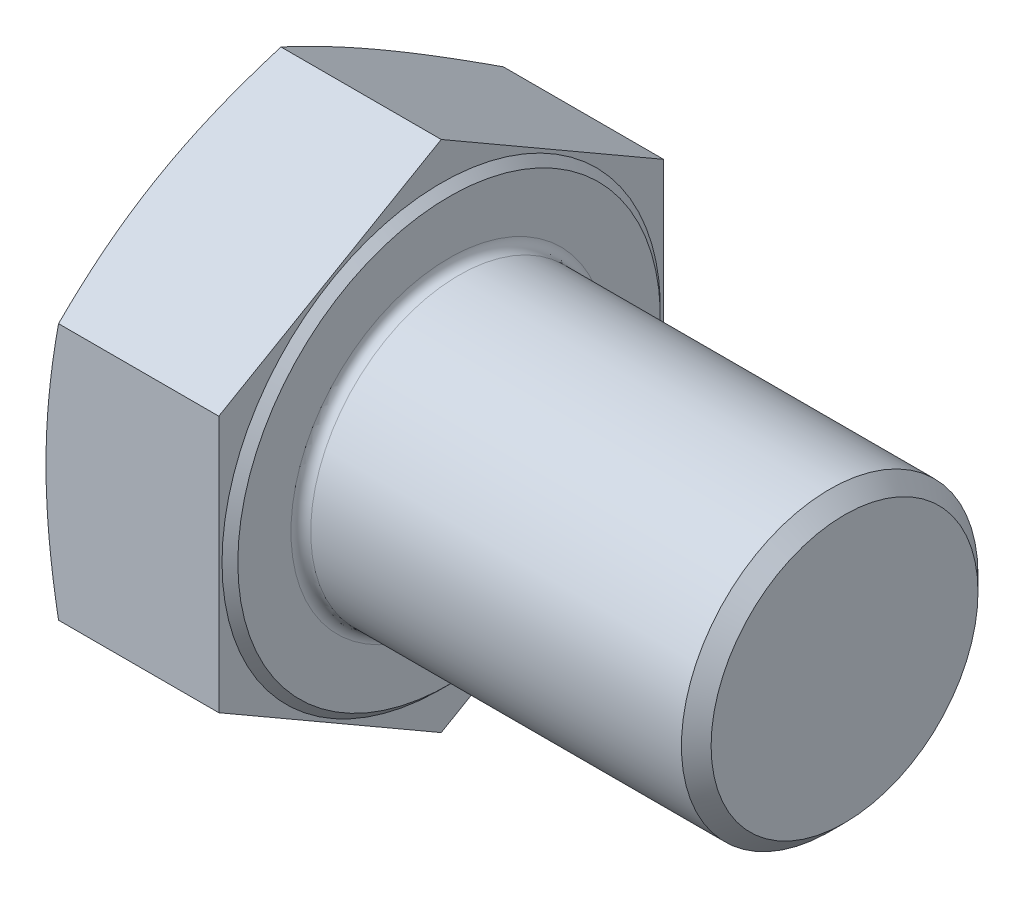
ISO-10303-21;
HEADER;
FILE_DESCRIPTION(('STEP AP214'),'2;1');
FILE_NAME('part.step','',(''),(''),'','','');
FILE_SCHEMA(('AUTOMOTIVE_DESIGN { 1 0 10303 214 1 1 1 1 }'));
ENDSEC;
DATA;
#1=APPLICATION_CONTEXT('core data for automotive mechanical design processes');
#2=APPLICATION_PROTOCOL_DEFINITION('international standard','automotive_design',2000,#1);
#3=PRODUCT_CONTEXT('',#1,'mechanical');
#4=PRODUCT('Part','Part','',(#3));
#5=PRODUCT_RELATED_PRODUCT_CATEGORY('part','',(#4));
#6=PRODUCT_DEFINITION_FORMATION('','',#4);
#7=PRODUCT_DEFINITION_CONTEXT('part definition',#1,'design');
#8=PRODUCT_DEFINITION('design','',#6,#7);
#9=PRODUCT_DEFINITION_SHAPE('','',#8);
#10=(LENGTH_UNIT() NAMED_UNIT(*) SI_UNIT(.MILLI.,.METRE.));
#11=(NAMED_UNIT(*) PLANE_ANGLE_UNIT() SI_UNIT($,.RADIAN.));
#12=(NAMED_UNIT(*) SI_UNIT($,.STERADIAN.) SOLID_ANGLE_UNIT());
#13=UNCERTAINTY_MEASURE_WITH_UNIT(LENGTH_MEASURE(1.E-05),#10,'distance_accuracy_value','');
#14=(GEOMETRIC_REPRESENTATION_CONTEXT(3) GLOBAL_UNCERTAINTY_ASSIGNED_CONTEXT((#13)) GLOBAL_UNIT_ASSIGNED_CONTEXT((#10,
#11,#12)) REPRESENTATION_CONTEXT('',''));
#15=CARTESIAN_POINT('',(0.,0.,0.));
#16=DIRECTION('',(0.,0.,1.));
#17=DIRECTION('',(1.,0.,0.));
#18=AXIS2_PLACEMENT_3D('',#15,#16,#17);
#19=CARTESIAN_POINT('',(18.28,-12.9903810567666,-22.5));
#20=DIRECTION('',(1.,0.,0.));
#21=DIRECTION('',(0.,0.,-1.));
#22=AXIS2_PLACEMENT_3D('',#19,#20,#21);
#23=PLANE('',#22);
#24=CARTESIAN_POINT('',(18.28,0.,0.));
#25=DIRECTION('',(1.,0.,0.));
#26=DIRECTION('',(0.,0.,-1.));
#27=AXIS2_PLACEMENT_3D('',#24,#25,#26);
#28=CIRCLE('',#27,16.);
#29=CARTESIAN_POINT('',(18.28,0.,-16.));
#30=VERTEX_POINT('',#29);
#31=EDGE_CURVE('E11',#30,#30,#28,.F.);
#32=ORIENTED_EDGE('',*,*,#31,.T.);
#33=EDGE_LOOP('',(#32));
#34=FACE_BOUND('',#33,.T.);
#35=CARTESIAN_POINT('',(18.28,0.,0.));
#36=DIRECTION('',(-1.,0.,0.));
#37=DIRECTION('',(0.,0.,1.));
#38=AXIS2_PLACEMENT_3D('',#35,#36,#37);
#39=CIRCLE('',#38,21.375);
#40=CARTESIAN_POINT('',(18.28,0.,21.375));
#41=VERTEX_POINT('',#40);
#42=EDGE_CURVE('E415',#41,#41,#39,.T.);
#43=ORIENTED_EDGE('',*,*,#42,.F.);
#44=EDGE_LOOP('',(#43));
#45=FACE_BOUND('',#44,.T.);
#46=ADVANCED_FACE('F34',(#34,#45),#23,.T.);
#47=CARTESIAN_POINT('',(18.28,-25.9807621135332,0.));
#48=DIRECTION('',(0.,0.866025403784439,0.5));
#49=DIRECTION('',(0.,-0.5,0.866025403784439));
#50=AXIS2_PLACEMENT_3D('',#47,#48,#49);
#51=PLANE('',#50);
#52=CARTESIAN_POINT('',(1.26693582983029,-12.9902655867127,-22.5002));
#53=CARTESIAN_POINT('',(1.16902690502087,-13.2592880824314,-22.0342393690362));
#54=CARTESIAN_POINT('',(1.07552121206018,-13.5287059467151,-21.5675939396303));
#55=CARTESIAN_POINT('',(0.898284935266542,-14.0683691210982,-20.6328699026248));
#56=CARTESIAN_POINT('',(0.814555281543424,-14.3386145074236,-20.1647911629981));
#57=CARTESIAN_POINT('',(0.579402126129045,-15.1509443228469,-18.757794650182));
#58=CARTESIAN_POINT('',(0.444152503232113,-15.6942505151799,-17.8167607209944));
#59=CARTESIAN_POINT('',(0.279780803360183,-16.5085280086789,-16.4063907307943));
#60=CARTESIAN_POINT('',(0.231546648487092,-16.7785598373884,-15.9386818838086));
#61=CARTESIAN_POINT('',(0.148249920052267,-17.3191276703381,-15.0023909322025));
#62=CARTESIAN_POINT('',(0.11318680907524,-17.5896636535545,-14.5338088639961));
#63=CARTESIAN_POINT('',(0.0568446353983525,-18.1310020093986,-13.5961833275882));
#64=CARTESIAN_POINT('',(0.0355608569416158,-18.4018042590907,-13.1271400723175));
#65=CARTESIAN_POINT('',(0.00713856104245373,-18.943594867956,-12.1887312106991));
#66=CARTESIAN_POINT('',(0.,-19.2145832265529,-11.7193656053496));
#67=CARTESIAN_POINT('',(0.,-19.7565599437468,-10.7806343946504));
#68=CARTESIAN_POINT('',(0.00713856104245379,-20.0275483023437,-10.3112687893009));
#69=CARTESIAN_POINT('',(0.0355608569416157,-20.569338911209,-9.37285992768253));
#70=CARTESIAN_POINT('',(0.0568446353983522,-20.8401411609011,-8.90381667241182));
#71=CARTESIAN_POINT('',(0.113186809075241,-21.3814795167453,-7.96619113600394));
#72=CARTESIAN_POINT('',(0.148249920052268,-21.6520154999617,-7.49760906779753));
#73=CARTESIAN_POINT('',(0.231546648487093,-22.1925833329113,-6.56131811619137));
#74=CARTESIAN_POINT('',(0.279780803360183,-22.4626151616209,-6.09360926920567));
#75=CARTESIAN_POINT('',(0.444152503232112,-23.2768926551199,-4.68323927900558));
#76=CARTESIAN_POINT('',(0.579402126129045,-23.8201988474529,-3.74220534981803));
#77=CARTESIAN_POINT('',(0.814555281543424,-24.6325286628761,-2.33520883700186));
#78=CARTESIAN_POINT('',(0.898284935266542,-24.9027740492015,-1.86713009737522));
#79=CARTESIAN_POINT('',(1.07552121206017,-25.4424372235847,-0.932406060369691));
#80=CARTESIAN_POINT('',(1.16902690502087,-25.7118550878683,-0.465760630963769));
#81=CARTESIAN_POINT('',(1.26693582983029,-25.980877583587,0.000200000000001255));
#82=B_SPLINE_CURVE_WITH_KNOTS('',3,(#52,#53,#54,#55,#56,#57,#58,#59,#60,#61,#62,#63,#64,#65,#66,
#67,#68,#69,#70,#71,#72,#73,#74,#75,#76,#77,#78,#79,#80,#81),.UNSPECIFIED.,.F.,.F.,(4,2,2,2,2,2,
2,2,2,2,2,2,2,2,4),(0.,1.64059355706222,3.28134307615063,6.56511024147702,8.19162193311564,
9.81806725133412,11.4439556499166,13.0698390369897,14.6957224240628,16.3216108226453,
17.9480561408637,19.5745678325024,22.8583349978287,24.4990845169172,26.1396780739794),.UNSPECIFIED.);
#83=CARTESIAN_POINT('',(1.26689380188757,-12.9903810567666,-22.5));
#84=VERTEX_POINT('',#83);
#85=CARTESIAN_POINT('',(0.,-19.4855715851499,-11.25));
#86=VERTEX_POINT('',#85);
#87=EDGE_CURVE('E113',#84,#86,#82,.T.);
#88=ORIENTED_EDGE('',*,*,#87,.F.);
#89=DIRECTION('',(-1.,0.,0.));
#90=VECTOR('',#89,1.);
#91=CARTESIAN_POINT('',(18.28,-12.9903810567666,-22.5));
#92=LINE('',#91,#90);
#93=CARTESIAN_POINT('',(17.48,-12.9903810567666,-22.5));
#94=VERTEX_POINT('',#93);
#95=EDGE_CURVE('E142',#94,#84,#92,.T.);
#96=ORIENTED_EDGE('',*,*,#95,.F.);
#97=DIRECTION('',(0.,0.5,-0.866025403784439));
#98=VECTOR('',#97,1.);
#99=CARTESIAN_POINT('',(17.48,-25.9807621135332,0.));
#100=LINE('',#99,#98);
#101=CARTESIAN_POINT('',(17.48,-25.9807621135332,0.));
#102=VERTEX_POINT('',#101);
#103=EDGE_CURVE('E427',#102,#94,#100,.T.);
#104=ORIENTED_EDGE('',*,*,#103,.F.);
#105=DIRECTION('',(-1.,0.,0.));
#106=VECTOR('',#105,1.);
#107=CARTESIAN_POINT('',(18.28,-25.9807621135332,0.));
#108=LINE('',#107,#106);
#109=CARTESIAN_POINT('',(1.26689380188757,-25.9807621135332,0.));
#110=VERTEX_POINT('',#109);
#111=EDGE_CURVE('E136',#102,#110,#108,.T.);
#112=ORIENTED_EDGE('',*,*,#111,.T.);
#113=EDGE_CURVE('E223',#86,#110,#82,.T.);
#114=ORIENTED_EDGE('',*,*,#113,.F.);
#115=EDGE_LOOP('',(#88,#96,#104,#112,#114));
#116=FACE_BOUND('',#115,.T.);
#117=ADVANCED_FACE('F36',(#116),#51,.F.);
#118=CARTESIAN_POINT('',(18.28,-12.9903810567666,-22.5));
#119=DIRECTION('',(0.,0.,1.));
#120=DIRECTION('',(1.,0.,0.));
#121=AXIS2_PLACEMENT_3D('',#118,#119,#120);
#122=PLANE('',#121);
#123=CARTESIAN_POINT('',(6.76977805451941,-34.3939613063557,-22.5));
#124=CARTESIAN_POINT('',(6.61475269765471,-33.8849780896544,-22.5));
#125=CARTESIAN_POINT('',(6.46066486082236,-33.3757094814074,-22.5));
#126=CARTESIAN_POINT('',(6.15457411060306,-32.3565430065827,-22.5));
#127=CARTESIAN_POINT('',(6.00257120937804,-31.8466451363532,-22.5));
#128=CARTESIAN_POINT('',(5.5499851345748,-30.3158533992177,-22.5));
#129=CARTESIAN_POINT('',(5.2528475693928,-29.2939366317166,-22.5));
#130=CARTESIAN_POINT('',(4.66933339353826,-27.244966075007,-22.5));
#131=CARTESIAN_POINT('',(4.38297789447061,-26.2179062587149,-22.5));
#132=CARTESIAN_POINT('',(3.82435576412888,-24.1599665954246,-22.5));
#133=CARTESIAN_POINT('',(3.55208887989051,-23.1290868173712,-22.5));
#134=CARTESIAN_POINT('',(3.02838958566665,-21.075558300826,-22.5));
#135=CARTESIAN_POINT('',(2.77674168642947,-20.0529647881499,-22.5));
#136=CARTESIAN_POINT('',(2.29487034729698,-18.0026892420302,-22.5));
#137=CARTESIAN_POINT('',(2.06464726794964,-16.9750071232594,-22.5));
#138=CARTESIAN_POINT('',(1.63099346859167,-14.9143243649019,-22.5));
#139=CARTESIAN_POINT('',(1.4275536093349,-13.8813256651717,-22.5));
#140=CARTESIAN_POINT('',(1.05366080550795,-11.8093309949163,-22.5));
#141=CARTESIAN_POINT('',(0.883206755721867,-10.7703352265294,-22.5));
#142=CARTESIAN_POINT('',(0.599087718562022,-8.80334142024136,-22.5));
#143=CARTESIAN_POINT('',(0.481198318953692,-7.87595930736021,-22.5));
#144=CARTESIAN_POINT('',(0.281639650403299,-6.01727365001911,-22.5));
#145=CARTESIAN_POINT('',(0.199969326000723,-5.0859702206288,-22.5));
#146=CARTESIAN_POINT('',(0.0767818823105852,-3.22133095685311,-22.5));
#147=CARTESIAN_POINT('',(0.0352363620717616,-2.28799702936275,-22.5));
#148=CARTESIAN_POINT('',(-0.00559802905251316,-0.420395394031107,-22.5));
#149=CARTESIAN_POINT('',(-0.00488719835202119,0.513872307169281,-22.5));
#150=CARTESIAN_POINT('',(0.0388631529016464,2.38614034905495,-22.5));
#151=CARTESIAN_POINT('',(0.0821173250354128,3.32413559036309,-22.5));
#152=CARTESIAN_POINT('',(0.208963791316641,5.19737094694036,-22.5));
#153=CARTESIAN_POINT('',(0.292557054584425,6.13261099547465,-22.5));
#154=CARTESIAN_POINT('',(0.496171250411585,7.99987415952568,-22.5));
#155=CARTESIAN_POINT('',(0.616223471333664,8.93189381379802,-22.5));
#156=CARTESIAN_POINT('',(0.887885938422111,10.791270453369,-22.5));
#157=CARTESIAN_POINT('',(1.03949635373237,11.7186274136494,-22.5));
#158=CARTESIAN_POINT('',(1.37806511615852,13.6174776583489,-22.5));
#159=CARTESIAN_POINT('',(1.56646900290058,14.5887109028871,-22.5));
#160=CARTESIAN_POINT('',(1.96752546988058,16.5261898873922,-22.5));
#161=CARTESIAN_POINT('',(2.18017987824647,17.4924352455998,-22.5));
#162=CARTESIAN_POINT('',(2.62527208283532,19.42062699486,-22.5));
#163=CARTESIAN_POINT('',(2.85771562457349,20.3825720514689,-22.5));
#164=CARTESIAN_POINT('',(3.33860492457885,22.3024099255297,-22.5));
#165=CARTESIAN_POINT('',(3.58705029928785,23.2603028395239,-22.5));
#166=CARTESIAN_POINT('',(4.09727957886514,25.1738346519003,-22.5));
#167=CARTESIAN_POINT('',(4.35908020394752,26.1294690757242,-22.5));
#168=CARTESIAN_POINT('',(4.89333122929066,28.0377523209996,-22.5));
#169=CARTESIAN_POINT('',(5.16578167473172,28.9904011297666,-22.5));
#170=CARTESIAN_POINT('',(5.71938307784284,30.8929884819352,-22.5));
#171=CARTESIAN_POINT('',(6.00053256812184,31.8429274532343,-22.5));
#172=CARTESIAN_POINT('',(6.57006413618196,33.7406289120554,-22.5));
#173=CARTESIAN_POINT('',(6.85844619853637,34.688391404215,-22.5));
#174=CARTESIAN_POINT('',(7.4380210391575,36.5716051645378,-22.5));
#175=CARTESIAN_POINT('',(7.729147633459,37.5070768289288,-22.5));
#176=CARTESIAN_POINT('',(8.31635992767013,39.3764609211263,-22.5));
#177=CARTESIAN_POINT('',(8.61244562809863,40.3103733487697,-22.5));
#178=CARTESIAN_POINT('',(9.20883136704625,42.1768976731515,-22.5));
#179=CARTESIAN_POINT('',(9.50913159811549,43.1095095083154,-22.5));
#180=CARTESIAN_POINT('',(10.1133153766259,44.9735719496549,-22.5));
#181=CARTESIAN_POINT('',(10.4171989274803,45.9050225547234,-22.5));
#182=CARTESIAN_POINT('',(11.0268823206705,47.763380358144,-22.5));
#183=CARTESIAN_POINT('',(11.3326705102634,48.6902913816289,-22.5));
#184=CARTESIAN_POINT('',(11.9468856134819,50.5432389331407,-22.5));
#185=CARTESIAN_POINT('',(12.2553125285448,51.4692754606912,-22.5));
#186=CARTESIAN_POINT('',(12.8744319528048,53.3205062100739,-22.5));
#187=CARTESIAN_POINT('',(13.1851242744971,54.2457004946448,-22.5));
#188=CARTESIAN_POINT('',(13.8085193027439,56.0954091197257,-22.5));
#189=CARTESIAN_POINT('',(14.121222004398,57.0199234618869,-22.5));
#190=CARTESIAN_POINT('',(14.4347905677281,57.9441433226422,-22.5));
#191=B_SPLINE_CURVE_WITH_KNOTS('',3,(#123,#124,#125,#126,#127,#128,#129,#130,#131,#132,#133,
#134,#135,#136,#137,#138,#139,#140,#141,#142,#143,#144,#145,#146,#147,#148,#149,#150,#151,#152,
#153,#154,#155,#156,#157,#158,#159,#160,#161,#162,#163,#164,#165,#166,#167,#168,#169,#170,#171,
#172,#173,#174,#175,#176,#177,#178,#179,#180,#181,#182,#183,#184,#185,#186,#187,#188,#189,#190),
.UNSPECIFIED.,.F.,.F.,(4,2,2,2,2,2,2,2,2,2,2,2,2,2,2,2,2,2,2,2,2,2,2,2,2,2,2,2,2,2,2,2,2,4),(0.,
1.59620348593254,3.19241627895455,6.38507782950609,9.58369609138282,12.7822569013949,
15.9413811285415,19.100558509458,22.2586550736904,25.4166458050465,28.2205656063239,
31.02440369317,33.8262557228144,36.6280879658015,39.444129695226,42.2602390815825,
45.0787720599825,47.8973201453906,50.8649551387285,53.8328139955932,56.8015374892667,
59.7701898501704,62.7426546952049,65.7151321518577,68.6871109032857,71.6590833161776,
74.5982434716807,77.5374039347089,80.4766991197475,83.4159971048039,86.3441377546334,
89.2722799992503,92.2001825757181,95.1280780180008),.UNSPECIFIED.);
#192=CARTESIAN_POINT('',(1.26689380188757,12.9903810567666,-22.5));
#193=VERTEX_POINT('',#192);
#194=CARTESIAN_POINT('',(0.,0.,-22.5));
#195=VERTEX_POINT('',#194);
#196=EDGE_CURVE('E234',#193,#195,#191,.F.);
#197=ORIENTED_EDGE('',*,*,#196,.F.);
#198=DIRECTION('',(-1.,0.,0.));
#199=VECTOR('',#198,1.);
#200=CARTESIAN_POINT('',(18.28,12.9903810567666,-22.5));
#201=LINE('',#200,#199);
#202=CARTESIAN_POINT('',(17.48,12.9903810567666,-22.5));
#203=VERTEX_POINT('',#202);
#204=EDGE_CURVE('E133',#203,#193,#201,.T.);
#205=ORIENTED_EDGE('',*,*,#204,.F.);
#206=DIRECTION('',(0.,1.,0.));
#207=VECTOR('',#206,1.);
#208=CARTESIAN_POINT('',(17.48,-12.9903810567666,-22.5));
#209=LINE('',#208,#207);
#210=EDGE_CURVE('E420',#94,#203,#209,.T.);
#211=ORIENTED_EDGE('',*,*,#210,.F.);
#212=ORIENTED_EDGE('',*,*,#95,.T.);
#213=EDGE_CURVE('E124',#195,#84,#191,.F.);
#214=ORIENTED_EDGE('',*,*,#213,.F.);
#215=EDGE_LOOP('',(#197,#205,#211,#212,#214));
#216=FACE_BOUND('',#215,.T.);
#217=ADVANCED_FACE('F181',(#216),#122,.F.);
#218=CARTESIAN_POINT('',(18.28,12.9903810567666,-22.5));
#219=DIRECTION('',(0.,-0.866025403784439,0.5));
#220=DIRECTION('',(0.,-0.5,-0.866025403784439));
#221=AXIS2_PLACEMENT_3D('',#218,#219,#220);
#222=PLANE('',#221);
#223=CARTESIAN_POINT('',(1.2669358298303,25.980877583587,0.000199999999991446));
#224=CARTESIAN_POINT('',(1.16902690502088,25.7118550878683,-0.465760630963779));
#225=CARTESIAN_POINT('',(1.07552121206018,25.4424372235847,-0.932406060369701));
#226=CARTESIAN_POINT('',(0.898284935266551,24.9027740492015,-1.86713009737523));
#227=CARTESIAN_POINT('',(0.814555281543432,24.6325286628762,-2.33520883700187));
#228=CARTESIAN_POINT('',(0.579402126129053,23.8201988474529,-3.74220534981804));
#229=CARTESIAN_POINT('',(0.44415250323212,23.2768926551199,-4.68323927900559));
#230=CARTESIAN_POINT('',(0.279780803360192,22.4626151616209,-6.09360926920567));
#231=CARTESIAN_POINT('',(0.231546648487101,22.1925833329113,-6.56131811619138));
#232=CARTESIAN_POINT('',(0.148249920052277,21.6520154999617,-7.49760906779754));
#233=CARTESIAN_POINT('',(0.113186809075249,21.3814795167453,-7.96619113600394));
#234=CARTESIAN_POINT('',(0.0568446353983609,20.8401411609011,-8.90381667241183));
#235=CARTESIAN_POINT('',(0.0355608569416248,20.569338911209,-9.37285992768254));
#236=CARTESIAN_POINT('',(0.00713856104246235,20.0275483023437,-10.3112687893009));
#237=CARTESIAN_POINT('',(0.,19.7565599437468,-10.7806343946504));
#238=CARTESIAN_POINT('',(0.,19.214583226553,-11.7193656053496));
#239=CARTESIAN_POINT('',(0.00713856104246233,18.943594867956,-12.1887312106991));
#240=CARTESIAN_POINT('',(0.0355608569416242,18.4018042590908,-13.1271400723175));
#241=CARTESIAN_POINT('',(0.0568446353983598,18.1310020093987,-13.5961833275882));
#242=CARTESIAN_POINT('',(0.113186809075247,17.5896636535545,-14.5338088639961));
#243=CARTESIAN_POINT('',(0.148249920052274,17.3191276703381,-15.0023909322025));
#244=CARTESIAN_POINT('',(0.231546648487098,16.7785598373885,-15.9386818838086));
#245=CARTESIAN_POINT('',(0.279780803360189,16.5085280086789,-16.4063907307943));
#246=CARTESIAN_POINT('',(0.444152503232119,15.6942505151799,-17.8167607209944));
#247=CARTESIAN_POINT('',(0.579402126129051,15.1509443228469,-18.757794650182));
#248=CARTESIAN_POINT('',(0.814555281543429,14.3386145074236,-20.1647911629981));
#249=CARTESIAN_POINT('',(0.898284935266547,14.0683691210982,-20.6328699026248));
#250=CARTESIAN_POINT('',(1.07552121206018,13.5287059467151,-21.5675939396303));
#251=CARTESIAN_POINT('',(1.16902690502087,13.2592880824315,-22.0342393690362));
#252=CARTESIAN_POINT('',(1.26693582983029,12.9902655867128,-22.5002));
#253=B_SPLINE_CURVE_WITH_KNOTS('',3,(#223,#224,#225,#226,#227,#228,#229,#230,#231,#232,#233,
#234,#235,#236,#237,#238,#239,#240,#241,#242,#243,#244,#245,#246,#247,#248,#249,#250,#251,#252),
.UNSPECIFIED.,.F.,.F.,(4,2,2,2,2,2,2,2,2,2,2,2,2,2,4),(0.,1.64059355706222,3.28134307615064,
6.56511024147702,8.19162193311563,9.81806725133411,11.4439556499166,13.0698390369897,
14.6957224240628,16.3216108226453,17.9480561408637,19.5745678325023,22.8583349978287,
24.4990845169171,26.1396780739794),.UNSPECIFIED.);
#254=CARTESIAN_POINT('',(1.26689380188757,25.9807621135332,0.));
#255=VERTEX_POINT('',#254);
#256=CARTESIAN_POINT('',(0.,19.4855715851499,-11.25));
#257=VERTEX_POINT('',#256);
#258=EDGE_CURVE('E50',#255,#257,#253,.T.);
#259=ORIENTED_EDGE('',*,*,#258,.F.);
#260=DIRECTION('',(-1.,0.,0.));
#261=VECTOR('',#260,1.);
#262=CARTESIAN_POINT('',(18.28,25.9807621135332,0.));
#263=LINE('',#262,#261);
#264=CARTESIAN_POINT('',(17.48,25.9807621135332,0.));
#265=VERTEX_POINT('',#264);
#266=EDGE_CURVE('E130',#265,#255,#263,.T.);
#267=ORIENTED_EDGE('',*,*,#266,.F.);
#268=DIRECTION('',(0.,0.5,0.866025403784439));
#269=VECTOR('',#268,1.);
#270=CARTESIAN_POINT('',(17.48,12.9903810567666,-22.5));
#271=LINE('',#270,#269);
#272=EDGE_CURVE('E418',#203,#265,#271,.T.);
#273=ORIENTED_EDGE('',*,*,#272,.F.);
#274=ORIENTED_EDGE('',*,*,#204,.T.);
#275=EDGE_CURVE('E235',#257,#193,#253,.T.);
#276=ORIENTED_EDGE('',*,*,#275,.F.);
#277=EDGE_LOOP('',(#259,#267,#273,#274,#276));
#278=FACE_BOUND('',#277,.T.);
#279=ADVANCED_FACE('F243',(#278),#222,.F.);
#280=CARTESIAN_POINT('',(18.28,25.9807621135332,0.));
#281=DIRECTION('',(0.,-0.866025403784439,-0.5));
#282=DIRECTION('',(0.,0.5,-0.866025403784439));
#283=AXIS2_PLACEMENT_3D('',#280,#281,#282);
#284=PLANE('',#283);
#285=CARTESIAN_POINT('',(1.2669358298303,12.9902655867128,22.5002));
#286=CARTESIAN_POINT('',(1.16902690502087,13.2592880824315,22.0342393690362));
#287=CARTESIAN_POINT('',(1.07552121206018,13.5287059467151,21.5675939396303));
#288=CARTESIAN_POINT('',(0.898284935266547,14.0683691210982,20.6328699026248));
#289=CARTESIAN_POINT('',(0.814555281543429,14.3386145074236,20.1647911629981));
#290=CARTESIAN_POINT('',(0.579402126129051,15.1509443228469,18.757794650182));
#291=CARTESIAN_POINT('',(0.444152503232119,15.6942505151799,17.8167607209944));
#292=CARTESIAN_POINT('',(0.279780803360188,16.5085280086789,16.4063907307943));
#293=CARTESIAN_POINT('',(0.231546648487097,16.7785598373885,15.9386818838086));
#294=CARTESIAN_POINT('',(0.148249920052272,17.3191276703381,15.0023909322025));
#295=CARTESIAN_POINT('',(0.113186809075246,17.5896636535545,14.5338088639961));
#296=CARTESIAN_POINT('',(0.0568446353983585,18.1310020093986,13.5961833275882));
#297=CARTESIAN_POINT('',(0.0355608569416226,18.4018042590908,13.1271400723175));
#298=CARTESIAN_POINT('',(0.00713856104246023,18.943594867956,12.1887312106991));
#299=CARTESIAN_POINT('',(0.,19.214583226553,11.7193656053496));
#300=CARTESIAN_POINT('',(0.,19.7565599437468,10.7806343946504));
#301=CARTESIAN_POINT('',(0.00713856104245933,20.0275483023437,10.3112687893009));
#302=CARTESIAN_POINT('',(0.0355608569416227,20.569338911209,9.37285992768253));
#303=CARTESIAN_POINT('',(0.0568446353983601,20.8401411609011,8.90381667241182));
#304=CARTESIAN_POINT('',(0.113186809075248,21.3814795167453,7.96619113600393));
#305=CARTESIAN_POINT('',(0.148249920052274,21.6520154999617,7.49760906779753));
#306=CARTESIAN_POINT('',(0.231546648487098,22.1925833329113,6.56131811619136));
#307=CARTESIAN_POINT('',(0.279780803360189,22.4626151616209,6.09360926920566));
#308=CARTESIAN_POINT('',(0.44415250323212,23.2768926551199,4.68323927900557));
#309=CARTESIAN_POINT('',(0.579402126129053,23.8201988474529,3.74220534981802));
#310=CARTESIAN_POINT('',(0.814555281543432,24.6325286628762,2.33520883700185));
#311=CARTESIAN_POINT('',(0.898284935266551,24.9027740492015,1.86713009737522));
#312=CARTESIAN_POINT('',(1.07552121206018,25.4424372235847,0.932406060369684));
#313=CARTESIAN_POINT('',(1.16902690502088,25.7118550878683,0.465760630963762));
#314=CARTESIAN_POINT('',(1.2669358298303,25.980877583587,-0.00020000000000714));
#315=B_SPLINE_CURVE_WITH_KNOTS('',3,(#285,#286,#287,#288,#289,#290,#291,#292,#293,#294,#295,
#296,#297,#298,#299,#300,#301,#302,#303,#304,#305,#306,#307,#308,#309,#310,#311,#312,#313,#314),
.UNSPECIFIED.,.F.,.F.,(4,2,2,2,2,2,2,2,2,2,2,2,2,2,4),(0.,1.64059355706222,3.28134307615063,
6.56511024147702,8.19162193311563,9.81806725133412,11.4439556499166,13.0698390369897,
14.6957224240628,16.3216108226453,17.9480561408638,19.5745678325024,22.8583349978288,
24.4990845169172,26.1396780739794),.UNSPECIFIED.);
#316=CARTESIAN_POINT('',(1.26689380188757,12.9903810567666,22.5));
#317=VERTEX_POINT('',#316);
#318=CARTESIAN_POINT('',(0.,19.4855715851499,11.25));
#319=VERTEX_POINT('',#318);
#320=EDGE_CURVE('E58',#317,#319,#315,.T.);
#321=ORIENTED_EDGE('',*,*,#320,.F.);
#322=DIRECTION('',(-1.,0.,0.));
#323=VECTOR('',#322,1.);
#324=CARTESIAN_POINT('',(18.28,12.9903810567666,22.5));
#325=LINE('',#324,#323);
#326=CARTESIAN_POINT('',(17.48,12.9903810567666,22.5));
#327=VERTEX_POINT('',#326);
#328=EDGE_CURVE('E121',#327,#317,#325,.T.);
#329=ORIENTED_EDGE('',*,*,#328,.F.);
#330=DIRECTION('',(0.,-0.5,0.866025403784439));
#331=VECTOR('',#330,1.);
#332=CARTESIAN_POINT('',(17.48,25.9807621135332,0.));
#333=LINE('',#332,#331);
#334=EDGE_CURVE('E416',#265,#327,#333,.T.);
#335=ORIENTED_EDGE('',*,*,#334,.F.);
#336=ORIENTED_EDGE('',*,*,#266,.T.);
#337=EDGE_CURVE('E123',#319,#255,#315,.T.);
#338=ORIENTED_EDGE('',*,*,#337,.F.);
#339=EDGE_LOOP('',(#321,#329,#335,#336,#338));
#340=FACE_BOUND('',#339,.T.);
#341=ADVANCED_FACE('F119',(#340),#284,.F.);
#342=CARTESIAN_POINT('',(18.28,12.9903810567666,22.5));
#343=DIRECTION('',(0.,0.,-1.));
#344=DIRECTION('',(-1.,0.,0.));
#345=AXIS2_PLACEMENT_3D('',#342,#343,#344);
#346=PLANE('',#345);
#347=CARTESIAN_POINT('',(6.76977805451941,-34.3939613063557,22.5));
#348=CARTESIAN_POINT('',(6.61475269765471,-33.8849780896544,22.5));
#349=CARTESIAN_POINT('',(6.46066486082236,-33.3757094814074,22.5));
#350=CARTESIAN_POINT('',(6.15457411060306,-32.3565430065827,22.5));
#351=CARTESIAN_POINT('',(6.00257120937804,-31.8466451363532,22.5));
#352=CARTESIAN_POINT('',(5.5499851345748,-30.3158533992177,22.5));
#353=CARTESIAN_POINT('',(5.2528475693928,-29.2939366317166,22.5));
#354=CARTESIAN_POINT('',(4.66933339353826,-27.244966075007,22.5));
#355=CARTESIAN_POINT('',(4.3829778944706,-26.2179062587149,22.5));
#356=CARTESIAN_POINT('',(3.82435576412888,-24.1599665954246,22.5));
#357=CARTESIAN_POINT('',(3.55208887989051,-23.1290868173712,22.5));
#358=CARTESIAN_POINT('',(3.02838958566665,-21.075558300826,22.5));
#359=CARTESIAN_POINT('',(2.77674168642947,-20.0529647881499,22.5));
#360=CARTESIAN_POINT('',(2.29487034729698,-18.0026892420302,22.5));
#361=CARTESIAN_POINT('',(2.06464726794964,-16.9750071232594,22.5));
#362=CARTESIAN_POINT('',(1.63099346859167,-14.9143243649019,22.5));
#363=CARTESIAN_POINT('',(1.4275536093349,-13.8813256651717,22.5));
#364=CARTESIAN_POINT('',(1.05366080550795,-11.8093309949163,22.5));
#365=CARTESIAN_POINT('',(0.883206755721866,-10.7703352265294,22.5));
#366=CARTESIAN_POINT('',(0.599087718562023,-8.80334142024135,22.5));
#367=CARTESIAN_POINT('',(0.481198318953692,-7.8759593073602,22.5));
#368=CARTESIAN_POINT('',(0.281639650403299,-6.01727365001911,22.5));
#369=CARTESIAN_POINT('',(0.199969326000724,-5.08597022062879,22.5));
#370=CARTESIAN_POINT('',(0.0767818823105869,-3.22133095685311,22.5));
#371=CARTESIAN_POINT('',(0.0352363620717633,-2.28799702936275,22.5));
#372=CARTESIAN_POINT('',(-0.00559802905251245,-0.420395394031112,22.5));
#373=CARTESIAN_POINT('',(-0.00488719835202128,0.513872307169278,22.5));
#374=CARTESIAN_POINT('',(0.0388631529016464,2.38614034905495,22.5));
#375=CARTESIAN_POINT('',(0.0821173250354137,3.32413559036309,22.5));
#376=CARTESIAN_POINT('',(0.208963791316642,5.19737094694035,22.5));
#377=CARTESIAN_POINT('',(0.292557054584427,6.13261099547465,22.5));
#378=CARTESIAN_POINT('',(0.496171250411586,7.99987415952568,22.5));
#379=CARTESIAN_POINT('',(0.616223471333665,8.93189381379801,22.5));
#380=CARTESIAN_POINT('',(0.887885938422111,10.7912704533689,22.5));
#381=CARTESIAN_POINT('',(1.03949635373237,11.7186274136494,22.5));
#382=CARTESIAN_POINT('',(1.37806511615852,13.6174776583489,22.5));
#383=CARTESIAN_POINT('',(1.56646900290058,14.5887109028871,22.5));
#384=CARTESIAN_POINT('',(1.96752546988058,16.5261898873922,22.5));
#385=CARTESIAN_POINT('',(2.18017987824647,17.4924352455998,22.5));
#386=CARTESIAN_POINT('',(2.62527208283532,19.42062699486,22.5));
#387=CARTESIAN_POINT('',(2.8577156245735,20.3825720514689,22.5));
#388=CARTESIAN_POINT('',(3.33860492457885,22.3024099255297,22.5));
#389=CARTESIAN_POINT('',(3.58705029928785,23.2603028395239,22.5));
#390=CARTESIAN_POINT('',(4.09727957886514,25.1738346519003,22.5));
#391=CARTESIAN_POINT('',(4.35908020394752,26.1294690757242,22.5));
#392=CARTESIAN_POINT('',(4.89333122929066,28.0377523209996,22.5));
#393=CARTESIAN_POINT('',(5.16578167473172,28.9904011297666,22.5));
#394=CARTESIAN_POINT('',(5.71938307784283,30.8929884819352,22.5));
#395=CARTESIAN_POINT('',(6.00053256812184,31.8429274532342,22.5));
#396=CARTESIAN_POINT('',(6.57006413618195,33.7406289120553,22.5));
#397=CARTESIAN_POINT('',(6.85844619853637,34.688391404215,22.5));
#398=CARTESIAN_POINT('',(7.4380210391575,36.5716051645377,22.5));
#399=CARTESIAN_POINT('',(7.729147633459,37.5070768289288,22.5));
#400=CARTESIAN_POINT('',(8.31635992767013,39.3764609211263,22.5));
#401=CARTESIAN_POINT('',(8.61244562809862,40.3103733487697,22.5));
#402=CARTESIAN_POINT('',(9.20883136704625,42.1768976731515,22.5));
#403=CARTESIAN_POINT('',(9.50913159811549,43.1095095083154,22.5));
#404=CARTESIAN_POINT('',(10.1133153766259,44.9735719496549,22.5));
#405=CARTESIAN_POINT('',(10.4171989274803,45.9050225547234,22.5));
#406=CARTESIAN_POINT('',(11.0268823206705,47.763380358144,22.5));
#407=CARTESIAN_POINT('',(11.3326705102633,48.6902913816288,22.5));
#408=CARTESIAN_POINT('',(11.9468856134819,50.5432389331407,22.5));
#409=CARTESIAN_POINT('',(12.2553125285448,51.4692754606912,22.5));
#410=CARTESIAN_POINT('',(12.8744319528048,53.3205062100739,22.5));
#411=CARTESIAN_POINT('',(13.1851242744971,54.2457004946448,22.5));
#412=CARTESIAN_POINT('',(13.8085193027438,56.0954091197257,22.5));
#413=CARTESIAN_POINT('',(14.121222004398,57.0199234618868,22.5));
#414=CARTESIAN_POINT('',(14.4347905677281,57.9441433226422,22.5));
#415=B_SPLINE_CURVE_WITH_KNOTS('',3,(#347,#348,#349,#350,#351,#352,#353,#354,#355,#356,#357,
#358,#359,#360,#361,#362,#363,#364,#365,#366,#367,#368,#369,#370,#371,#372,#373,#374,#375,#376,
#377,#378,#379,#380,#381,#382,#383,#384,#385,#386,#387,#388,#389,#390,#391,#392,#393,#394,#395,
#396,#397,#398,#399,#400,#401,#402,#403,#404,#405,#406,#407,#408,#409,#410,#411,#412,#413,#414),
.UNSPECIFIED.,.F.,.F.,(4,2,2,2,2,2,2,2,2,2,2,2,2,2,2,2,2,2,2,2,2,2,2,2,2,2,2,2,2,2,2,2,2,4),(0.,
1.59620348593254,3.19241627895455,6.38507782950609,9.58369609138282,12.7822569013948,
15.9413811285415,19.100558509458,22.2586550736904,25.4166458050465,28.2205656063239,
31.02440369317,33.8262557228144,36.6280879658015,39.444129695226,42.2602390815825,
45.0787720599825,47.8973201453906,50.8649551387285,53.8328139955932,56.8015374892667,
59.7701898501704,62.7426546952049,65.7151321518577,68.6871109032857,71.6590833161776,
74.5982434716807,77.5374039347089,80.4766991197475,83.4159971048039,86.3441377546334,
89.2722799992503,92.2001825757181,95.1280780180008),.UNSPECIFIED.);
#416=CARTESIAN_POINT('',(1.26689380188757,-12.9903810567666,22.5));
#417=VERTEX_POINT('',#416);
#418=CARTESIAN_POINT('',(0.,0.,22.5));
#419=VERTEX_POINT('',#418);
#420=EDGE_CURVE('E115',#417,#419,#415,.T.);
#421=ORIENTED_EDGE('',*,*,#420,.F.);
#422=DIRECTION('',(-1.,0.,0.));
#423=VECTOR('',#422,1.);
#424=CARTESIAN_POINT('',(18.28,-12.9903810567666,22.5));
#425=LINE('',#424,#423);
#426=CARTESIAN_POINT('',(17.48,-12.9903810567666,22.5));
#427=VERTEX_POINT('',#426);
#428=EDGE_CURVE('E131',#427,#417,#425,.T.);
#429=ORIENTED_EDGE('',*,*,#428,.F.);
#430=DIRECTION('',(0.,-1.,0.));
#431=VECTOR('',#430,1.);
#432=CARTESIAN_POINT('',(17.48,12.9903810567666,22.5));
#433=LINE('',#432,#431);
#434=EDGE_CURVE('E129',#327,#427,#433,.T.);
#435=ORIENTED_EDGE('',*,*,#434,.F.);
#436=ORIENTED_EDGE('',*,*,#328,.T.);
#437=EDGE_CURVE('E105',#419,#317,#415,.T.);
#438=ORIENTED_EDGE('',*,*,#437,.F.);
#439=EDGE_LOOP('',(#421,#429,#435,#436,#438));
#440=FACE_BOUND('',#439,.T.);
#441=ADVANCED_FACE('F127',(#440),#346,.F.);
#442=CARTESIAN_POINT('',(18.28,-12.9903810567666,22.5));
#443=DIRECTION('',(0.,0.866025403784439,-0.5));
#444=DIRECTION('',(0.,0.5,0.866025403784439));
#445=AXIS2_PLACEMENT_3D('',#442,#443,#444);
#446=PLANE('',#445);
#447=CARTESIAN_POINT('',(1.26693582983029,-25.980877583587,-0.000199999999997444));
#448=CARTESIAN_POINT('',(1.16902690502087,-25.7118550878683,0.465760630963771));
#449=CARTESIAN_POINT('',(1.07552121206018,-25.4424372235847,0.932406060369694));
#450=CARTESIAN_POINT('',(0.898284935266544,-24.9027740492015,1.86713009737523));
#451=CARTESIAN_POINT('',(0.814555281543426,-24.6325286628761,2.33520883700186));
#452=CARTESIAN_POINT('',(0.579402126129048,-23.8201988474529,3.74220534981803));
#453=CARTESIAN_POINT('',(0.444152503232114,-23.2768926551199,4.68323927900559));
#454=CARTESIAN_POINT('',(0.279780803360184,-22.4626151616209,6.09360926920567));
#455=CARTESIAN_POINT('',(0.231546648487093,-22.1925833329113,6.56131811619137));
#456=CARTESIAN_POINT('',(0.148249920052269,-21.6520154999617,7.49760906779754));
#457=CARTESIAN_POINT('',(0.113186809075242,-21.3814795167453,7.96619113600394));
#458=CARTESIAN_POINT('',(0.0568446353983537,-20.8401411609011,8.90381667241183));
#459=CARTESIAN_POINT('',(0.0355608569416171,-20.569338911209,9.37285992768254));
#460=CARTESIAN_POINT('',(0.00713856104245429,-20.0275483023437,10.3112687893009));
#461=CARTESIAN_POINT('',(0.,-19.7565599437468,10.7806343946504));
#462=CARTESIAN_POINT('',(0.,-19.2145832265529,11.7193656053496));
#463=CARTESIAN_POINT('',(0.00713856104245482,-18.943594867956,12.1887312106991));
#464=CARTESIAN_POINT('',(0.0355608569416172,-18.4018042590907,13.1271400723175));
#465=CARTESIAN_POINT('',(0.056844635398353,-18.1310020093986,13.5961833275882));
#466=CARTESIAN_POINT('',(0.11318680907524,-17.5896636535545,14.5338088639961));
#467=CARTESIAN_POINT('',(0.148249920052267,-17.3191276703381,15.0023909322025));
#468=CARTESIAN_POINT('',(0.231546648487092,-16.7785598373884,15.9386818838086));
#469=CARTESIAN_POINT('',(0.279780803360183,-16.5085280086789,16.4063907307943));
#470=CARTESIAN_POINT('',(0.444152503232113,-15.6942505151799,17.8167607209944));
#471=CARTESIAN_POINT('',(0.579402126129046,-15.1509443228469,18.757794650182));
#472=CARTESIAN_POINT('',(0.814555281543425,-14.3386145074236,20.1647911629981));
#473=CARTESIAN_POINT('',(0.898284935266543,-14.0683691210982,20.6328699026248));
#474=CARTESIAN_POINT('',(1.07552121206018,-13.5287059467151,21.5675939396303));
#475=CARTESIAN_POINT('',(1.16902690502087,-13.2592880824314,22.0342393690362));
#476=CARTESIAN_POINT('',(1.26693582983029,-12.9902655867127,22.5002));
#477=B_SPLINE_CURVE_WITH_KNOTS('',3,(#447,#448,#449,#450,#451,#452,#453,#454,#455,#456,#457,
#458,#459,#460,#461,#462,#463,#464,#465,#466,#467,#468,#469,#470,#471,#472,#473,#474,#475,#476),
.UNSPECIFIED.,.F.,.F.,(4,2,2,2,2,2,2,2,2,2,2,2,2,2,4),(0.,1.64059355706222,3.28134307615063,
6.56511024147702,8.19162193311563,9.81806725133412,11.4439556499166,13.0698390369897,
14.6957224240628,16.3216108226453,17.9480561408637,19.5745678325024,22.8583349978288,
24.4990845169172,26.1396780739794),.UNSPECIFIED.);
#478=CARTESIAN_POINT('',(0.,-19.4855715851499,11.25));
#479=VERTEX_POINT('',#478);
#480=EDGE_CURVE('E203',#110,#479,#477,.T.);
#481=ORIENTED_EDGE('',*,*,#480,.F.);
#482=ORIENTED_EDGE('',*,*,#111,.F.);
#483=DIRECTION('',(0.,-0.5,-0.866025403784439));
#484=VECTOR('',#483,1.);
#485=CARTESIAN_POINT('',(17.48,-12.9903810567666,22.5));
#486=LINE('',#485,#484);
#487=EDGE_CURVE('E145',#427,#102,#486,.T.);
#488=ORIENTED_EDGE('',*,*,#487,.F.);
#489=ORIENTED_EDGE('',*,*,#428,.T.);
#490=EDGE_CURVE('E197',#479,#417,#477,.T.);
#491=ORIENTED_EDGE('',*,*,#490,.F.);
#492=EDGE_LOOP('',(#481,#482,#488,#489,#491));
#493=FACE_BOUND('',#492,.T.);
#494=ADVANCED_FACE('F188',(#493),#446,.F.);
#495=CARTESIAN_POINT('',(17.48,22.175,0.));
#496=DIRECTION('',(1.,0.,0.));
#497=DIRECTION('',(0.,0.,-1.));
#498=AXIS2_PLACEMENT_3D('',#495,#496,#497);
#499=PLANE('',#498);
#500=CARTESIAN_POINT('',(17.48,0.,0.));
#501=DIRECTION('',(-1.,0.,0.));
#502=DIRECTION('',(0.,0.,1.));
#503=AXIS2_PLACEMENT_3D('',#500,#501,#502);
#504=CIRCLE('',#503,22.175);
#505=CARTESIAN_POINT('',(17.48,0.,22.175));
#506=VERTEX_POINT('',#505);
#507=EDGE_CURVE('E422',#506,#506,#504,.T.);
#508=ORIENTED_EDGE('',*,*,#507,.T.);
#509=EDGE_LOOP('',(#508));
#510=FACE_BOUND('',#509,.T.);
#511=ORIENTED_EDGE('',*,*,#103,.T.);
#512=ORIENTED_EDGE('',*,*,#210,.T.);
#513=ORIENTED_EDGE('',*,*,#272,.T.);
#514=ORIENTED_EDGE('',*,*,#334,.T.);
#515=ORIENTED_EDGE('',*,*,#434,.T.);
#516=ORIENTED_EDGE('',*,*,#487,.T.);
#517=EDGE_LOOP('',(#511,#512,#513,#514,#515,#516));
#518=FACE_BOUND('',#517,.T.);
#519=ADVANCED_FACE('F192',(#510,#518),#499,.T.);
#520=CARTESIAN_POINT('',(17.48,0.,0.));
#521=DIRECTION('',(-1.,0.,0.));
#522=DIRECTION('',(0.,0.,1.));
#523=AXIS2_PLACEMENT_3D('',#520,#521,#522);
#524=CONICAL_SURFACE('',#523,22.175,0.78539816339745);
#525=ORIENTED_EDGE('',*,*,#42,.T.);
#526=EDGE_LOOP('',(#525));
#527=FACE_BOUND('',#526,.T.);
#528=ORIENTED_EDGE('',*,*,#507,.F.);
#529=EDGE_LOOP('',(#528));
#530=FACE_BOUND('',#529,.T.);
#531=ADVANCED_FACE('F216',(#527,#530),#524,.T.);
#532=CARTESIAN_POINT('',(0.,0.,0.));
#533=DIRECTION('',(1.,0.,0.));
#534=DIRECTION('',(0.,0.,-1.));
#535=AXIS2_PLACEMENT_3D('',#532,#533,#534);
#536=CONICAL_SURFACE('',#535,22.5,1.22173047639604);
#537=ORIENTED_EDGE('',*,*,#213,.T.);
#538=ORIENTED_EDGE('',*,*,#87,.T.);
#539=CARTESIAN_POINT('',(0.,0.,0.));
#540=DIRECTION('',(1.,0.,0.));
#541=DIRECTION('',(0.,0.,-1.));
#542=AXIS2_PLACEMENT_3D('',#539,#540,#541);
#543=CIRCLE('',#542,22.5);
#544=EDGE_CURVE('E147',#86,#195,#543,.T.);
#545=ORIENTED_EDGE('',*,*,#544,.T.);
#546=EDGE_LOOP('',(#537,#538,#545));
#547=FACE_BOUND('',#546,.T.);
#548=ADVANCED_FACE('F272',(#547),#536,.T.);
#549=ORIENTED_EDGE('',*,*,#113,.T.);
#550=ORIENTED_EDGE('',*,*,#480,.T.);
#551=EDGE_CURVE('E150',#479,#86,#543,.T.);
#552=ORIENTED_EDGE('',*,*,#551,.T.);
#553=EDGE_LOOP('',(#549,#550,#552));
#554=FACE_BOUND('',#553,.T.);
#555=ADVANCED_FACE('F279',(#554),#536,.T.);
#556=ORIENTED_EDGE('',*,*,#420,.T.);
#557=EDGE_CURVE('E412',#419,#479,#543,.T.);
#558=ORIENTED_EDGE('',*,*,#557,.T.);
#559=ORIENTED_EDGE('',*,*,#490,.T.);
#560=EDGE_LOOP('',(#556,#558,#559));
#561=FACE_BOUND('',#560,.T.);
#562=ADVANCED_FACE('F214',(#561),#536,.T.);
#563=ORIENTED_EDGE('',*,*,#320,.T.);
#564=CARTESIAN_POINT('',(0.,0.,0.));
#565=DIRECTION('',(-1.,0.,0.));
#566=DIRECTION('',(0.,0.,1.));
#567=AXIS2_PLACEMENT_3D('',#564,#565,#566);
#568=CIRCLE('',#567,22.5);
#569=EDGE_CURVE('E108',#419,#319,#568,.T.);
#570=ORIENTED_EDGE('',*,*,#569,.F.);
#571=ORIENTED_EDGE('',*,*,#437,.T.);
#572=EDGE_LOOP('',(#563,#570,#571));
#573=FACE_BOUND('',#572,.T.);
#574=ADVANCED_FACE('F106',(#573),#536,.T.);
#575=ORIENTED_EDGE('',*,*,#258,.T.);
#576=EDGE_CURVE('E396',#257,#319,#543,.T.);
#577=ORIENTED_EDGE('',*,*,#576,.T.);
#578=ORIENTED_EDGE('',*,*,#337,.T.);
#579=EDGE_LOOP('',(#575,#577,#578));
#580=FACE_BOUND('',#579,.T.);
#581=ADVANCED_FACE('F208',(#580),#536,.T.);
#582=ORIENTED_EDGE('',*,*,#275,.T.);
#583=ORIENTED_EDGE('',*,*,#196,.T.);
#584=EDGE_CURVE('E151',#195,#257,#543,.T.);
#585=ORIENTED_EDGE('',*,*,#584,.T.);
#586=EDGE_LOOP('',(#582,#583,#585));
#587=FACE_BOUND('',#586,.T.);
#588=ADVANCED_FACE('F213',(#587),#536,.T.);
#589=CARTESIAN_POINT('',(0.,-12.9903810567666,-22.5));
#590=DIRECTION('',(1.,0.,0.));
#591=DIRECTION('',(0.,0.,-1.));
#592=AXIS2_PLACEMENT_3D('',#589,#590,#591);
#593=PLANE('',#592);
#594=ORIENTED_EDGE('',*,*,#584,.F.);
#595=ORIENTED_EDGE('',*,*,#544,.F.);
#596=ORIENTED_EDGE('',*,*,#551,.F.);
#597=ORIENTED_EDGE('',*,*,#557,.F.);
#598=ORIENTED_EDGE('',*,*,#569,.T.);
#599=ORIENTED_EDGE('',*,*,#576,.F.);
#600=EDGE_LOOP('',(#594,#595,#596,#597,#598,#599));
#601=FACE_BOUND('',#600,.T.);
#602=ADVANCED_FACE('F186',(#601),#593,.F.);
#603=CARTESIAN_POINT('',(58.28,0.,0.));
#604=DIRECTION('',(-1.,0.,0.));
#605=DIRECTION('',(0.,0.,1.));
#606=AXIS2_PLACEMENT_3D('',#603,#604,#605);
#607=CYLINDRICAL_SURFACE('',#606,15.);
#608=CARTESIAN_POINT('',(19.28,0.,0.));
#609=DIRECTION('',(1.,0.,0.));
#610=DIRECTION('',(0.,0.,-1.));
#611=AXIS2_PLACEMENT_3D('',#608,#609,#610);
#612=CIRCLE('',#611,15.);
#613=CARTESIAN_POINT('',(19.28,0.,-15.));
#614=VERTEX_POINT('',#613);
#615=EDGE_CURVE('E43',#614,#614,#612,.T.);
#616=ORIENTED_EDGE('',*,*,#615,.T.);
#617=EDGE_LOOP('',(#616));
#618=FACE_BOUND('',#617,.T.);
#619=CARTESIAN_POINT('',(56.78,0.,0.));
#620=DIRECTION('',(1.,0.,0.));
#621=DIRECTION('',(0.,0.,-1.));
#622=AXIS2_PLACEMENT_3D('',#619,#620,#621);
#623=CIRCLE('',#622,15.);
#624=CARTESIAN_POINT('',(56.78,0.,-15.));
#625=VERTEX_POINT('',#624);
#626=EDGE_CURVE('E155',#625,#625,#623,.F.);
#627=ORIENTED_EDGE('',*,*,#626,.T.);
#628=EDGE_LOOP('',(#627));
#629=FACE_BOUND('',#628,.T.);
#630=ADVANCED_FACE('F160',(#618,#629),#607,.T.);
#631=CARTESIAN_POINT('',(58.28,0.,0.));
#632=DIRECTION('',(1.,0.,0.));
#633=DIRECTION('',(0.,0.,-1.));
#634=AXIS2_PLACEMENT_3D('',#631,#632,#633);
#635=PLANE('',#634);
#636=CARTESIAN_POINT('',(58.28,0.,0.));
#637=DIRECTION('',(1.,0.,0.));
#638=DIRECTION('',(0.,0.,-1.));
#639=AXIS2_PLACEMENT_3D('',#636,#637,#638);
#640=CIRCLE('',#639,13.5);
#641=CARTESIAN_POINT('',(58.28,0.,-13.5));
#642=VERTEX_POINT('',#641);
#643=EDGE_CURVE('E152',#642,#642,#640,.T.);
#644=ORIENTED_EDGE('',*,*,#643,.T.);
#645=EDGE_LOOP('',(#644));
#646=FACE_BOUND('',#645,.T.);
#647=ADVANCED_FACE('F171',(#646),#635,.T.);
#648=CARTESIAN_POINT('',(58.28,0.,0.));
#649=DIRECTION('',(-1.,0.,0.));
#650=DIRECTION('',(0.,0.,1.));
#651=AXIS2_PLACEMENT_3D('',#648,#649,#650);
#652=CONICAL_SURFACE('',#651,13.5,0.785398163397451);
#653=ORIENTED_EDGE('',*,*,#626,.F.);
#654=EDGE_LOOP('',(#653));
#655=FACE_BOUND('',#654,.T.);
#656=ORIENTED_EDGE('',*,*,#643,.F.);
#657=EDGE_LOOP('',(#656));
#658=FACE_BOUND('',#657,.T.);
#659=ADVANCED_FACE('F165',(#655,#658),#652,.T.);
#660=CARTESIAN_POINT('',(19.28,0.,0.));
#661=DIRECTION('',(1.,0.,0.));
#662=DIRECTION('',(0.,0.,-1.));
#663=AXIS2_PLACEMENT_3D('',#660,#661,#662);
#664=TOROIDAL_SURFACE('',#663,16.,1.);
#665=ORIENTED_EDGE('',*,*,#31,.F.);
#666=EDGE_LOOP('',(#665));
#667=FACE_BOUND('',#666,.T.);
#668=ORIENTED_EDGE('',*,*,#615,.F.);
#669=EDGE_LOOP('',(#668));
#670=FACE_BOUND('',#669,.T.);
#671=ADVANCED_FACE('F163',(#667,#670),#664,.F.);
#672=CLOSED_SHELL('',(#46,#117,#217,#279,#341,#441,#494,#519,#531,#548,#555,#562,#574,#581,#588,
#602,#630,#647,#659,#671));
#673=MANIFOLD_SOLID_BREP('B2',#672);
#674=ADVANCED_BREP_SHAPE_REPRESENTATION('',(#18,#673),#14);
#675=SHAPE_DEFINITION_REPRESENTATION(#9,#674);
ENDSEC;
END-ISO-10303-21;
